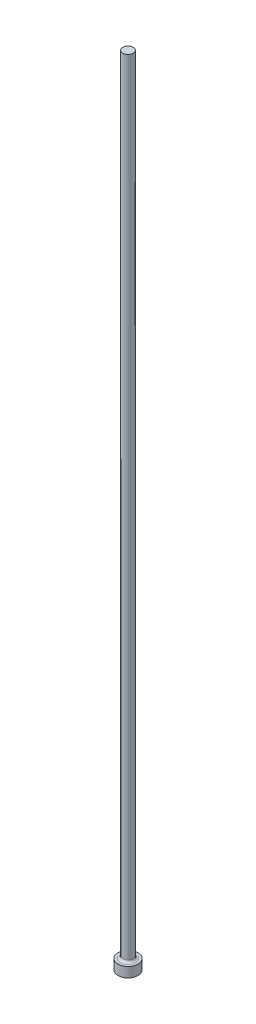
from build123d import *


with BuildPart() as part:
    # Sketch1 → Revolve1 (revolve)
    with BuildSketch(Plane.XY, mode=Mode.PRIVATE) as revolve1_sk:
        with BuildLine():
            Line((0, 0), (3.175, 0))
            Line((3.175, 0), (3.175, 3.175))
            Line((3.175, 3.175), (2.413, 3.175))
            ThreePointArc((2.413, 3.175), (1.874184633, 3.398184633), (1.651, 3.937))
            Line((1.651, 3.937), (1.651, 254))
            Line((1.651, 254), (0, 254))
            Line((0, 254), (0, 0))
        make_face()
    revolve(revolve1_sk.sketch.rotate(Axis((0, 254, 0), (0, -1, 0)), 180), axis=Axis((0, 254, 0), (0, -1, 0)))


solid = part.part
